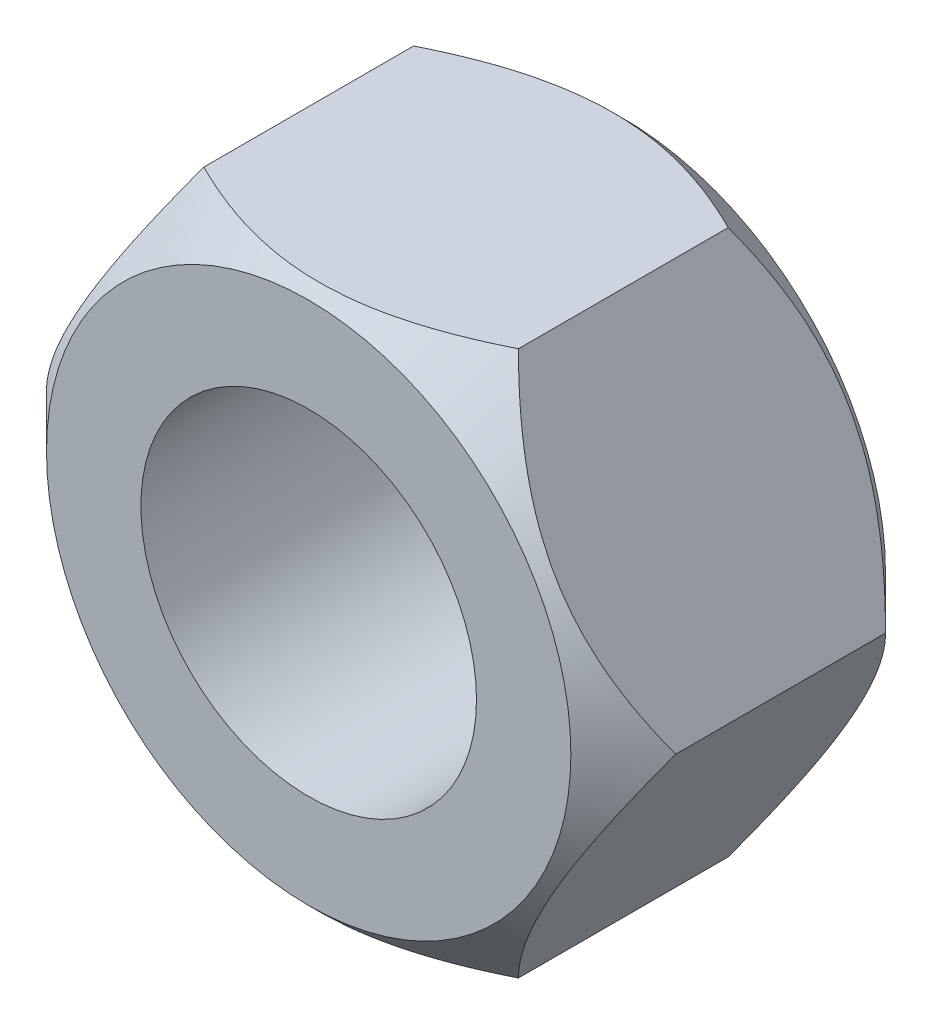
ISO-10303-21;
HEADER;
FILE_DESCRIPTION(('STEP AP214'),'2;1');
FILE_NAME('part.step','',(''),(''),'','','');
FILE_SCHEMA(('AUTOMOTIVE_DESIGN { 1 0 10303 214 1 1 1 1 }'));
ENDSEC;
DATA;
#1=APPLICATION_CONTEXT('core data for automotive mechanical design processes');
#2=APPLICATION_PROTOCOL_DEFINITION('international standard','automotive_design',2000,#1);
#3=PRODUCT_CONTEXT('',#1,'mechanical');
#4=PRODUCT('Part','Part','',(#3));
#5=PRODUCT_RELATED_PRODUCT_CATEGORY('part','',(#4));
#6=PRODUCT_DEFINITION_FORMATION('','',#4);
#7=PRODUCT_DEFINITION_CONTEXT('part definition',#1,'design');
#8=PRODUCT_DEFINITION('design','',#6,#7);
#9=PRODUCT_DEFINITION_SHAPE('','',#8);
#10=(LENGTH_UNIT() NAMED_UNIT(*) SI_UNIT(.MILLI.,.METRE.));
#11=(NAMED_UNIT(*) PLANE_ANGLE_UNIT() SI_UNIT($,.RADIAN.));
#12=(NAMED_UNIT(*) SI_UNIT($,.STERADIAN.) SOLID_ANGLE_UNIT());
#13=UNCERTAINTY_MEASURE_WITH_UNIT(LENGTH_MEASURE(1.E-05),#10,'distance_accuracy_value','');
#14=(GEOMETRIC_REPRESENTATION_CONTEXT(3) GLOBAL_UNCERTAINTY_ASSIGNED_CONTEXT((#13)) GLOBAL_UNIT_ASSIGNED_CONTEXT((#10,
#11,#12)) REPRESENTATION_CONTEXT('',''));
#15=CARTESIAN_POINT('',(0.,0.,0.));
#16=DIRECTION('',(0.,0.,1.));
#17=DIRECTION('',(1.,0.,0.));
#18=AXIS2_PLACEMENT_3D('',#15,#16,#17);
#19=CARTESIAN_POINT('',(0.,0.,0.500000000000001));
#20=DIRECTION('',(0.,0.,1.));
#21=DIRECTION('',(1.,0.,0.));
#22=AXIS2_PLACEMENT_3D('',#19,#20,#21);
#23=CONICAL_SURFACE('',#22,3.,0.78539816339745);
#24=CARTESIAN_POINT('',(0.,0.,0.));
#25=DIRECTION('',(0.,0.,1.));
#26=DIRECTION('',(1.,0.,0.));
#27=AXIS2_PLACEMENT_3D('',#24,#25,#26);
#28=CIRCLE('',#27,2.5);
#29=CARTESIAN_POINT('',(2.5,0.,0.));
#30=VERTEX_POINT('',#29);
#31=EDGE_CURVE('E220',#30,#30,#28,.F.);
#32=ORIENTED_EDGE('',*,*,#31,.F.);
#33=EDGE_LOOP('',(#32));
#34=FACE_BOUND('',#33,.T.);
#35=CARTESIAN_POINT('',(-3.09092547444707,-2.59807621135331,1.53779894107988));
#36=CARTESIAN_POINT('',(-3.01609560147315,-2.59807621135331,1.48052976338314));
#37=CARTESIAN_POINT('',(-2.94085808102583,-2.59807621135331,1.42378477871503));
#38=CARTESIAN_POINT('',(-2.78940274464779,-2.59807621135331,1.3115813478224));
#39=CARTESIAN_POINT('',(-2.71318469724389,-2.59807621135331,1.25612321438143));
#40=CARTESIAN_POINT('',(-2.55904595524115,-2.59807621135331,1.14633691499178));
#41=CARTESIAN_POINT('',(-2.48111665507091,-2.59807621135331,1.0920207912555));
#42=CARTESIAN_POINT('',(-2.3239535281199,-2.59807621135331,0.985316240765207));
#43=CARTESIAN_POINT('',(-2.24471979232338,-2.59807621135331,0.932927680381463));
#44=CARTESIAN_POINT('',(-2.07978975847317,-2.59807621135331,0.827351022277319));
#45=CARTESIAN_POINT('',(-1.99399660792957,-2.59807621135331,0.774313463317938));
#46=CARTESIAN_POINT('',(-1.82042376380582,-2.59807621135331,0.671600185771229));
#47=CARTESIAN_POINT('',(-1.73264433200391,-2.59807621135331,0.621924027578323));
#48=CARTESIAN_POINT('',(-1.55504638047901,-2.59807621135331,0.526971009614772));
#49=CARTESIAN_POINT('',(-1.46523449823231,-2.59807621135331,0.48168183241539));
#50=CARTESIAN_POINT('',(-1.2830963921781,-2.59807621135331,0.396525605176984));
#51=CARTESIAN_POINT('',(-1.19077136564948,-2.59807621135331,0.35665602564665));
#52=CARTESIAN_POINT('',(-1.01220342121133,-2.59807621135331,0.287192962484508));
#53=CARTESIAN_POINT('',(-0.926201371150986,-2.59807621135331,0.256986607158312));
#54=CARTESIAN_POINT('',(-0.752039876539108,-2.59807621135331,0.203461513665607));
#55=CARTESIAN_POINT('',(-0.663880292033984,-2.59807621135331,0.18014322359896));
#56=CARTESIAN_POINT('',(-0.487445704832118,-2.59807621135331,0.142031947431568));
#57=CARTESIAN_POINT('',(-0.399204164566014,-2.59807621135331,0.127086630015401));
#58=CARTESIAN_POINT('',(-0.221667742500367,-2.59807621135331,0.106027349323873));
#59=CARTESIAN_POINT('',(-0.132373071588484,-2.59807621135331,0.0999116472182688));
#60=CARTESIAN_POINT('',(0.0426616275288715,-2.59807621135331,0.0970138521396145));
#61=CARTESIAN_POINT('',(0.128395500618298,-2.59807621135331,0.0998552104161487));
#62=CARTESIAN_POINT('',(0.299175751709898,-2.59807621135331,0.113859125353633));
#63=CARTESIAN_POINT('',(0.384222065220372,-2.59807621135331,0.125022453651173));
#64=CARTESIAN_POINT('',(0.554454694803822,-2.59807621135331,0.155234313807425));
#65=CARTESIAN_POINT('',(0.639616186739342,-2.59807621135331,0.174420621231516));
#66=CARTESIAN_POINT('',(0.808061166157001,-2.59807621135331,0.219628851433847));
#67=CARTESIAN_POINT('',(0.89134477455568,-2.59807621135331,0.245650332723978));
#68=CARTESIAN_POINT('',(1.14922819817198,-2.59807621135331,0.336125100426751));
#69=CARTESIAN_POINT('',(1.32028918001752,-2.59807621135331,0.410699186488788));
#70=CARTESIAN_POINT('',(1.57063806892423,-2.59807621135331,0.535072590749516));
#71=CARTESIAN_POINT('',(1.65320141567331,-2.59807621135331,0.578712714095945));
#72=CARTESIAN_POINT('',(1.81645750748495,-2.59807621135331,0.669369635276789));
#73=CARTESIAN_POINT('',(1.89715058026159,-2.59807621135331,0.716385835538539));
#74=CARTESIAN_POINT('',(2.05293461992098,-2.59807621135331,0.81072400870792));
#75=CARTESIAN_POINT('',(2.12810528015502,-2.59807621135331,0.857915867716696));
#76=CARTESIAN_POINT('',(2.27715698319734,-2.59807621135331,0.954303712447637));
#77=CARTESIAN_POINT('',(2.3510379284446,-2.59807621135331,1.00349984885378));
#78=CARTESIAN_POINT('',(2.49708171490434,-2.59807621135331,1.10313535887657));
#79=CARTESIAN_POINT('',(2.56925360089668,-2.59807621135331,1.15356152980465));
#80=CARTESIAN_POINT('',(2.71260816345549,-2.59807621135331,1.2557612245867));
#81=CARTESIAN_POINT('',(2.7837911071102,-2.59807621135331,1.30753437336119));
#82=CARTESIAN_POINT('',(2.85455959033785,-2.59807621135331,1.35985886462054));
#83=B_SPLINE_CURVE_WITH_KNOTS('',3,(#35,#36,#37,#38,#39,#40,#41,#42,#43,#44,#45,#46,#47,#48,#49,
#50,#51,#52,#53,#54,#55,#56,#57,#58,#59,#60,#61,#62,#63,#64,#65,#66,#67,#68,#69,#70,#71,#72,#73,
#74,#75,#76,#77,#78,#79,#80,#81,#82),.UNSPECIFIED.,.F.,.F.,(4,2,2,2,2,2,2,2,2,2,2,2,2,2,2,2,2,2,
2,2,2,2,2,4),(0.,0.282694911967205,0.565457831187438,0.850405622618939,1.13533362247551,
1.43786342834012,1.74035359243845,2.04196820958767,2.34344156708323,2.61666213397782,
2.88990047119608,3.15799130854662,3.42602934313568,3.68295179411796,3.93989807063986,
4.20145080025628,4.46298664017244,5.02108363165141,5.30122174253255,5.58131039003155,
5.84754726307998,6.11380418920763,6.37791688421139,6.64195680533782),.UNSPECIFIED.);
#84=CARTESIAN_POINT('',(1.5,-2.59807621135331,0.499999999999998));
#85=VERTEX_POINT('',#84);
#86=CARTESIAN_POINT('',(-1.5,-2.59807621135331,0.499999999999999));
#87=VERTEX_POINT('',#86);
#88=EDGE_CURVE('E113',#85,#87,#83,.F.);
#89=ORIENTED_EDGE('',*,*,#88,.T.);
#90=CARTESIAN_POINT('',(-1.49988452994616,-2.59827621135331,0.500115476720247));
#91=CARTESIAN_POINT('',(-1.55144722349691,-2.50896700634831,0.448596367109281));
#92=CARTESIAN_POINT('',(-1.60387211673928,-2.41816442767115,0.400103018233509));
#93=CARTESIAN_POINT('',(-1.71077226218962,-2.23300794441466,0.3113127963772));
#94=CARTESIAN_POINT('',(-1.76525768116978,-2.13863643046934,0.271065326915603));
#95=CARTESIAN_POINT('',(-1.87512493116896,-1.94834077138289,0.20212059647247));
#96=CARTESIAN_POINT('',(-1.93047878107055,-1.85246509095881,0.173250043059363));
#97=CARTESIAN_POINT('',(-2.04240509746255,-1.65860302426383,0.128768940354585));
#98=CARTESIAN_POINT('',(-2.09897414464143,-1.56062256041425,0.113125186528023));
#99=CARTESIAN_POINT('',(-2.19646775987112,-1.39175866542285,0.0990104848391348));
#100=CARTESIAN_POINT('',(-2.237266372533,-1.32109339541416,0.0969210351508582));
#101=CARTESIAN_POINT('',(-2.31879690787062,-1.1798783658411,0.100441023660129));
#102=CARTESIAN_POINT('',(-2.35952880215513,-1.10932865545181,0.106053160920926));
#103=CARTESIAN_POINT('',(-2.44060798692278,-0.968895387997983,0.124656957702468));
#104=CARTESIAN_POINT('',(-2.48095479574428,-0.899012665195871,0.13765687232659));
#105=CARTESIAN_POINT('',(-2.5609507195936,-0.760455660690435,0.170322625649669));
#106=CARTESIAN_POINT('',(-2.60059988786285,-0.691781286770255,0.189987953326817));
#107=CARTESIAN_POINT('',(-2.70215750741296,-0.5158783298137,0.248368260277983));
#108=CARTESIAN_POINT('',(-2.76343628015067,-0.409740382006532,0.291483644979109));
#109=CARTESIAN_POINT('',(-2.853541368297,-0.253673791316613,0.364268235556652));
#110=CARTESIAN_POINT('',(-2.88323502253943,-0.20224287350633,0.389841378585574));
#111=CARTESIAN_POINT('',(-2.94207231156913,-0.100333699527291,0.443318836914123));
#112=CARTESIAN_POINT('',(-2.97121627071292,-0.0498548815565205,0.47122172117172));
#113=CARTESIAN_POINT('',(-3.00011547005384,0.000200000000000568,0.500115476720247));
#114=B_SPLINE_CURVE_WITH_KNOTS('',3,(#90,#91,#92,#93,#94,#95,#96,#97,#98,#99,#100,#101,#102,
#103,#104,#105,#106,#107,#108,#109,#110,#111,#112,#113),.UNSPECIFIED.,.F.,.F.,(4,2,2,2,2,2,2,2,
2,2,2,4),(0.,0.346074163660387,0.694164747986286,1.03672682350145,1.37842635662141,
1.62295169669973,1.86756275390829,2.11244767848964,2.35731383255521,2.74625844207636,
2.94020339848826,3.13403008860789),.UNSPECIFIED.);
#115=CARTESIAN_POINT('',(-3.,0.,0.499999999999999));
#116=VERTEX_POINT('',#115);
#117=EDGE_CURVE('E97',#87,#116,#114,.T.);
#118=ORIENTED_EDGE('',*,*,#117,.T.);
#119=CARTESIAN_POINT('',(-3.00011547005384,-0.000199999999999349,0.500115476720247));
#120=CARTESIAN_POINT('',(-2.94855277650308,0.0891092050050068,0.448596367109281));
#121=CARTESIAN_POINT('',(-2.89612788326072,0.179911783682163,0.400103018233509));
#122=CARTESIAN_POINT('',(-2.78922773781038,0.36506826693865,0.311312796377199));
#123=CARTESIAN_POINT('',(-2.73474231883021,0.459439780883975,0.271065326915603));
#124=CARTESIAN_POINT('',(-2.62487506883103,0.649735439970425,0.20212059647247));
#125=CARTESIAN_POINT('',(-2.56952121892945,0.745611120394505,0.173250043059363));
#126=CARTESIAN_POINT('',(-2.45759490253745,0.939473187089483,0.128768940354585));
#127=CARTESIAN_POINT('',(-2.40102585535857,1.03745365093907,0.113125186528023));
#128=CARTESIAN_POINT('',(-2.30353224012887,1.20631754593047,0.099010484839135));
#129=CARTESIAN_POINT('',(-2.262733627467,1.27698281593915,0.0969210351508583));
#130=CARTESIAN_POINT('',(-2.18120309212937,1.41819784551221,0.100441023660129));
#131=CARTESIAN_POINT('',(-2.14047119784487,1.4887475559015,0.106053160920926));
#132=CARTESIAN_POINT('',(-2.05939201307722,1.62918082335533,0.124656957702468));
#133=CARTESIAN_POINT('',(-2.01904520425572,1.69906354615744,0.13765687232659));
#134=CARTESIAN_POINT('',(-1.9390492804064,1.83762055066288,0.170322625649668));
#135=CARTESIAN_POINT('',(-1.89940011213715,1.90629492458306,0.189987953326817));
#136=CARTESIAN_POINT('',(-1.79784249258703,2.08219788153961,0.248368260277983));
#137=CARTESIAN_POINT('',(-1.73656371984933,2.18833582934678,0.291483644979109));
#138=CARTESIAN_POINT('',(-1.646458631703,2.3444024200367,0.364268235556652));
#139=CARTESIAN_POINT('',(-1.61676497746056,2.39583333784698,0.389841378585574));
#140=CARTESIAN_POINT('',(-1.55792768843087,2.49774251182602,0.443318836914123));
#141=CARTESIAN_POINT('',(-1.52878372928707,2.54822132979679,0.47122172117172));
#142=CARTESIAN_POINT('',(-1.49988452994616,2.59827621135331,0.500115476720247));
#143=B_SPLINE_CURVE_WITH_KNOTS('',3,(#119,#120,#121,#122,#123,#124,#125,#126,#127,#128,#129,
#130,#131,#132,#133,#134,#135,#136,#137,#138,#139,#140,#141,#142),.UNSPECIFIED.,.F.,.F.,(4,2,2,
2,2,2,2,2,2,2,2,4),(0.,0.346074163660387,0.694164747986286,1.03672682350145,1.37842635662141,
1.62295169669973,1.86756275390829,2.11244767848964,2.35731383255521,2.74625844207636,
2.94020339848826,3.13403008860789),.UNSPECIFIED.);
#144=CARTESIAN_POINT('',(-1.5,2.59807621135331,0.499999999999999));
#145=VERTEX_POINT('',#144);
#146=EDGE_CURVE('E163',#116,#145,#143,.T.);
#147=ORIENTED_EDGE('',*,*,#146,.T.);
#148=CARTESIAN_POINT('',(-3.09092547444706,2.59807621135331,1.53779894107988));
#149=CARTESIAN_POINT('',(-3.01609560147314,2.59807621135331,1.48052976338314));
#150=CARTESIAN_POINT('',(-2.94085808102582,2.59807621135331,1.42378477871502));
#151=CARTESIAN_POINT('',(-2.78940274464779,2.59807621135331,1.3115813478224));
#152=CARTESIAN_POINT('',(-2.71318469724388,2.59807621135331,1.25612321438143));
#153=CARTESIAN_POINT('',(-2.55904595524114,2.59807621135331,1.14633691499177));
#154=CARTESIAN_POINT('',(-2.48111665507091,2.59807621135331,1.0920207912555));
#155=CARTESIAN_POINT('',(-2.32395352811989,2.59807621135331,0.985316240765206));
#156=CARTESIAN_POINT('',(-2.24471979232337,2.59807621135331,0.932927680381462));
#157=CARTESIAN_POINT('',(-2.07978975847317,2.59807621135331,0.827351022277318));
#158=CARTESIAN_POINT('',(-1.99399660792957,2.59807621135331,0.774313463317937));
#159=CARTESIAN_POINT('',(-1.82042376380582,2.59807621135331,0.671600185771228));
#160=CARTESIAN_POINT('',(-1.73264433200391,2.59807621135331,0.621924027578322));
#161=CARTESIAN_POINT('',(-1.55504638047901,2.59807621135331,0.526971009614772));
#162=CARTESIAN_POINT('',(-1.46523449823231,2.59807621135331,0.48168183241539));
#163=CARTESIAN_POINT('',(-1.2830963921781,2.59807621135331,0.396525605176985));
#164=CARTESIAN_POINT('',(-1.19077136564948,2.59807621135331,0.356656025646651));
#165=CARTESIAN_POINT('',(-1.01220342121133,2.59807621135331,0.287192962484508));
#166=CARTESIAN_POINT('',(-0.926201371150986,2.59807621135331,0.256986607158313));
#167=CARTESIAN_POINT('',(-0.752039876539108,2.59807621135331,0.203461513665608));
#168=CARTESIAN_POINT('',(-0.663880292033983,2.59807621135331,0.180143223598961));
#169=CARTESIAN_POINT('',(-0.487445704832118,2.59807621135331,0.142031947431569));
#170=CARTESIAN_POINT('',(-0.399204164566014,2.59807621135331,0.127086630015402));
#171=CARTESIAN_POINT('',(-0.221667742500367,2.59807621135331,0.106027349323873));
#172=CARTESIAN_POINT('',(-0.132373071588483,2.59807621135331,0.0999116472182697));
#173=CARTESIAN_POINT('',(0.0426616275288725,2.59807621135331,0.0970138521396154));
#174=CARTESIAN_POINT('',(0.128395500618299,2.59807621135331,0.0998552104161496));
#175=CARTESIAN_POINT('',(0.2991757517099,2.59807621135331,0.113859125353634));
#176=CARTESIAN_POINT('',(0.384222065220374,2.59807621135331,0.125022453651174));
#177=CARTESIAN_POINT('',(0.554454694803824,2.59807621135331,0.155234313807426));
#178=CARTESIAN_POINT('',(0.639616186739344,2.59807621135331,0.174420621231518));
#179=CARTESIAN_POINT('',(0.808061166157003,2.59807621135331,0.219628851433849));
#180=CARTESIAN_POINT('',(0.891344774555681,2.59807621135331,0.245650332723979));
#181=CARTESIAN_POINT('',(1.14922819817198,2.59807621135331,0.336125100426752));
#182=CARTESIAN_POINT('',(1.32028918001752,2.59807621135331,0.41069918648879));
#183=CARTESIAN_POINT('',(1.57063806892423,2.59807621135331,0.535072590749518));
#184=CARTESIAN_POINT('',(1.65320141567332,2.59807621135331,0.578712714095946));
#185=CARTESIAN_POINT('',(1.81645750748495,2.59807621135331,0.669369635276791));
#186=CARTESIAN_POINT('',(1.89715058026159,2.59807621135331,0.716385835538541));
#187=CARTESIAN_POINT('',(2.05293461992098,2.59807621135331,0.810724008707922));
#188=CARTESIAN_POINT('',(2.12810528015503,2.59807621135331,0.857915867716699));
#189=CARTESIAN_POINT('',(2.27715698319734,2.59807621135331,0.954303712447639));
#190=CARTESIAN_POINT('',(2.3510379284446,2.59807621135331,1.00349984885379));
#191=CARTESIAN_POINT('',(2.49708171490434,2.59807621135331,1.10313535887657));
#192=CARTESIAN_POINT('',(2.56925360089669,2.59807621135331,1.15356152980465));
#193=CARTESIAN_POINT('',(2.71260816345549,2.59807621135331,1.25576122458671));
#194=CARTESIAN_POINT('',(2.78379110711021,2.59807621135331,1.3075343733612));
#195=CARTESIAN_POINT('',(2.85455959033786,2.59807621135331,1.35985886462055));
#196=B_SPLINE_CURVE_WITH_KNOTS('',3,(#148,#149,#150,#151,#152,#153,#154,#155,#156,#157,#158,
#159,#160,#161,#162,#163,#164,#165,#166,#167,#168,#169,#170,#171,#172,#173,#174,#175,#176,#177,
#178,#179,#180,#181,#182,#183,#184,#185,#186,#187,#188,#189,#190,#191,#192,#193,#194,#195),
.UNSPECIFIED.,.F.,.F.,(4,2,2,2,2,2,2,2,2,2,2,2,2,2,2,2,2,2,2,2,2,2,2,4),(0.,0.282694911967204,
0.565457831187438,0.850405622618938,1.13533362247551,1.43786342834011,1.74035359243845,
2.04196820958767,2.34344156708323,2.61666213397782,2.88990047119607,3.15799130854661,
3.42602934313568,3.68295179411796,3.93989807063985,4.20145080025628,4.46298664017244,
5.0210836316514,5.30122174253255,5.58131039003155,5.84754726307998,6.11380418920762,
6.37791688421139,6.64195680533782),.UNSPECIFIED.);
#197=CARTESIAN_POINT('',(1.5,2.59807621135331,0.499999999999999));
#198=VERTEX_POINT('',#197);
#199=EDGE_CURVE('E53',#145,#198,#196,.T.);
#200=ORIENTED_EDGE('',*,*,#199,.T.);
#201=CARTESIAN_POINT('',(1.49988452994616,2.59827621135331,0.500115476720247));
#202=CARTESIAN_POINT('',(1.55144722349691,2.50896700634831,0.44859636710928));
#203=CARTESIAN_POINT('',(1.60387211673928,2.41816442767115,0.400103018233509));
#204=CARTESIAN_POINT('',(1.71077226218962,2.23300794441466,0.311312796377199));
#205=CARTESIAN_POINT('',(1.76525768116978,2.13863643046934,0.271065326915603));
#206=CARTESIAN_POINT('',(1.87512493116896,1.94834077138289,0.20212059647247));
#207=CARTESIAN_POINT('',(1.93047878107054,1.85246509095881,0.173250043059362));
#208=CARTESIAN_POINT('',(2.04240509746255,1.65860302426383,0.128768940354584));
#209=CARTESIAN_POINT('',(2.09897414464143,1.56062256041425,0.113125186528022));
#210=CARTESIAN_POINT('',(2.19646775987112,1.39175866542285,0.0990104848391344));
#211=CARTESIAN_POINT('',(2.23726637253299,1.32109339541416,0.0969210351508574));
#212=CARTESIAN_POINT('',(2.31879690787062,1.1798783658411,0.100441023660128));
#213=CARTESIAN_POINT('',(2.35952880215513,1.10932865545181,0.106053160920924));
#214=CARTESIAN_POINT('',(2.44060798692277,0.968895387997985,0.124656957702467));
#215=CARTESIAN_POINT('',(2.48095479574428,0.899012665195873,0.137656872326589));
#216=CARTESIAN_POINT('',(2.5609507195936,0.760455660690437,0.170322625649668));
#217=CARTESIAN_POINT('',(2.60059988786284,0.691781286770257,0.189987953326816));
#218=CARTESIAN_POINT('',(2.70215750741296,0.515878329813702,0.248368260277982));
#219=CARTESIAN_POINT('',(2.76343628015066,0.409740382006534,0.291483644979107));
#220=CARTESIAN_POINT('',(2.853541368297,0.253673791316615,0.36426823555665));
#221=CARTESIAN_POINT('',(2.88323502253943,0.202242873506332,0.389841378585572));
#222=CARTESIAN_POINT('',(2.94207231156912,0.100333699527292,0.443318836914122));
#223=CARTESIAN_POINT('',(2.97121627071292,0.0498548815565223,0.471221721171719));
#224=CARTESIAN_POINT('',(3.00011547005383,-0.000199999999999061,0.500115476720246));
#225=B_SPLINE_CURVE_WITH_KNOTS('',3,(#201,#202,#203,#204,#205,#206,#207,#208,#209,#210,#211,
#212,#213,#214,#215,#216,#217,#218,#219,#220,#221,#222,#223,#224),.UNSPECIFIED.,.F.,.F.,(4,2,2,
2,2,2,2,2,2,2,2,4),(0.,0.346074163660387,0.694164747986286,1.03672682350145,1.37842635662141,
1.62295169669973,1.86756275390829,2.11244767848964,2.35731383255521,2.74625844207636,
2.94020339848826,3.13403008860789),.UNSPECIFIED.);
#226=CARTESIAN_POINT('',(3.,0.,0.499999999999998));
#227=VERTEX_POINT('',#226);
#228=EDGE_CURVE('E61',#198,#227,#225,.T.);
#229=ORIENTED_EDGE('',*,*,#228,.T.);
#230=CARTESIAN_POINT('',(3.00011547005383,0.000200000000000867,0.500115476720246));
#231=CARTESIAN_POINT('',(2.94855277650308,-0.0891092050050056,0.448596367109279));
#232=CARTESIAN_POINT('',(2.89612788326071,-0.179911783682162,0.400103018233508));
#233=CARTESIAN_POINT('',(2.78922773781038,-0.365068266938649,0.311312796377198));
#234=CARTESIAN_POINT('',(2.73474231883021,-0.459439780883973,0.271065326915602));
#235=CARTESIAN_POINT('',(2.62487506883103,-0.649735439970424,0.202120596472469));
#236=CARTESIAN_POINT('',(2.56952121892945,-0.745611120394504,0.173250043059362));
#237=CARTESIAN_POINT('',(2.45759490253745,-0.939473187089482,0.128768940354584));
#238=CARTESIAN_POINT('',(2.40102585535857,-1.03745365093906,0.113125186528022));
#239=CARTESIAN_POINT('',(2.30353224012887,-1.20631754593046,0.0990104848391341));
#240=CARTESIAN_POINT('',(2.262733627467,-1.27698281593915,0.0969210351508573));
#241=CARTESIAN_POINT('',(2.18120309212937,-1.41819784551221,0.100441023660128));
#242=CARTESIAN_POINT('',(2.14047119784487,-1.4887475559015,0.106053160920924));
#243=CARTESIAN_POINT('',(2.05939201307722,-1.62918082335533,0.124656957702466));
#244=CARTESIAN_POINT('',(2.01904520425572,-1.69906354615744,0.137656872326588));
#245=CARTESIAN_POINT('',(1.9390492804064,-1.83762055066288,0.170322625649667));
#246=CARTESIAN_POINT('',(1.89940011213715,-1.90629492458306,0.189987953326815));
#247=CARTESIAN_POINT('',(1.79784249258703,-2.08219788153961,0.248368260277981));
#248=CARTESIAN_POINT('',(1.73656371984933,-2.18833582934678,0.291483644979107));
#249=CARTESIAN_POINT('',(1.646458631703,-2.3444024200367,0.36426823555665));
#250=CARTESIAN_POINT('',(1.61676497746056,-2.39583333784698,0.389841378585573));
#251=CARTESIAN_POINT('',(1.55792768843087,-2.49774251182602,0.443318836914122));
#252=CARTESIAN_POINT('',(1.52878372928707,-2.54822132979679,0.471221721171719));
#253=CARTESIAN_POINT('',(1.49988452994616,-2.59827621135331,0.500115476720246));
#254=B_SPLINE_CURVE_WITH_KNOTS('',3,(#230,#231,#232,#233,#234,#235,#236,#237,#238,#239,#240,
#241,#242,#243,#244,#245,#246,#247,#248,#249,#250,#251,#252,#253),.UNSPECIFIED.,.F.,.F.,(4,2,2,
2,2,2,2,2,2,2,2,4),(0.,0.346074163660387,0.694164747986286,1.03672682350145,1.37842635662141,
1.62295169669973,1.86756275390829,2.11244767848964,2.35731383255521,2.74625844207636,
2.94020339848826,3.13403008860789),.UNSPECIFIED.);
#255=EDGE_CURVE('E146',#227,#85,#254,.T.);
#256=ORIENTED_EDGE('',*,*,#255,.T.);
#257=EDGE_LOOP('',(#89,#118,#147,#200,#229,#256));
#258=FACE_BOUND('',#257,.T.);
#259=ADVANCED_FACE('F33',(#34,#258),#23,.T.);
#260=CARTESIAN_POINT('',(0.,0.,3.));
#261=DIRECTION('',(0.,0.,-1.));
#262=DIRECTION('',(-1.,0.,0.));
#263=AXIS2_PLACEMENT_3D('',#260,#261,#262);
#264=CONICAL_SURFACE('',#263,2.5,0.785398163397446);
#265=CARTESIAN_POINT('',(0.,0.,3.));
#266=DIRECTION('',(0.,0.,1.));
#267=DIRECTION('',(1.,0.,0.));
#268=AXIS2_PLACEMENT_3D('',#265,#266,#267);
#269=CIRCLE('',#268,2.5);
#270=CARTESIAN_POINT('',(2.5,0.,3.));
#271=VERTEX_POINT('',#270);
#272=EDGE_CURVE('E46',#271,#271,#269,.T.);
#273=ORIENTED_EDGE('',*,*,#272,.F.);
#274=EDGE_LOOP('',(#273));
#275=FACE_BOUND('',#274,.T.);
#276=CARTESIAN_POINT('',(-1.49988452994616,2.59827621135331,2.49988452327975));
#277=CARTESIAN_POINT('',(-1.55144722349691,2.50896700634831,2.55140363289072));
#278=CARTESIAN_POINT('',(-1.60387211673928,2.41816442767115,2.59989698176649));
#279=CARTESIAN_POINT('',(-1.71077226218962,2.23300794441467,2.6886872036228));
#280=CARTESIAN_POINT('',(-1.76525768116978,2.13863643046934,2.72893467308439));
#281=CARTESIAN_POINT('',(-1.87512493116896,1.94834077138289,2.79787940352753));
#282=CARTESIAN_POINT('',(-1.93047878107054,1.85246509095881,2.82674995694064));
#283=CARTESIAN_POINT('',(-2.04240509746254,1.65860302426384,2.87123105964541));
#284=CARTESIAN_POINT('',(-2.09897414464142,1.56062256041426,2.88687481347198));
#285=CARTESIAN_POINT('',(-2.19646775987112,1.39175866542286,2.90098951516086));
#286=CARTESIAN_POINT('',(-2.23726637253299,1.32109339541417,2.90307896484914));
#287=CARTESIAN_POINT('',(-2.31879690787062,1.17987836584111,2.89955897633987));
#288=CARTESIAN_POINT('',(-2.35952880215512,1.10932865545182,2.89394683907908));
#289=CARTESIAN_POINT('',(-2.44060798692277,0.968895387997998,2.87534304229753));
#290=CARTESIAN_POINT('',(-2.48095479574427,0.899012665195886,2.86234312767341));
#291=CARTESIAN_POINT('',(-2.56095071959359,0.760455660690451,2.82967737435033));
#292=CARTESIAN_POINT('',(-2.60059988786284,0.691781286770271,2.81001204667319));
#293=CARTESIAN_POINT('',(-2.70215750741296,0.515878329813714,2.75163173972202));
#294=CARTESIAN_POINT('',(-2.76343628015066,0.409740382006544,2.7085163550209));
#295=CARTESIAN_POINT('',(-2.85354136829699,0.253673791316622,2.63573176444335));
#296=CARTESIAN_POINT('',(-2.88323502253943,0.202242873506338,2.61015862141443));
#297=CARTESIAN_POINT('',(-2.94207231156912,0.100333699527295,2.55668116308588));
#298=CARTESIAN_POINT('',(-2.97121627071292,0.0498548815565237,2.52877827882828));
#299=CARTESIAN_POINT('',(-3.00011547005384,-0.00019999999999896,2.49988452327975));
#300=B_SPLINE_CURVE_WITH_KNOTS('',3,(#276,#277,#278,#279,#280,#281,#282,#283,#284,#285,#286,
#287,#288,#289,#290,#291,#292,#293,#294,#295,#296,#297,#298,#299),.UNSPECIFIED.,.F.,.F.,(4,2,2,
2,2,2,2,2,2,2,2,4),(0.,0.346074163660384,0.694164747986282,1.03672682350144,1.3784263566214,
1.62295169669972,1.86756275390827,2.11244767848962,2.35731383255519,2.74625844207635,
2.94020339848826,3.13403008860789),.UNSPECIFIED.);
#301=CARTESIAN_POINT('',(-1.5,2.59807621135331,2.5));
#302=VERTEX_POINT('',#301);
#303=CARTESIAN_POINT('',(-3.,0.,2.5));
#304=VERTEX_POINT('',#303);
#305=EDGE_CURVE('E11',#302,#304,#300,.T.);
#306=ORIENTED_EDGE('',*,*,#305,.T.);
#307=CARTESIAN_POINT('',(-3.00011547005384,0.000200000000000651,2.49988452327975));
#308=CARTESIAN_POINT('',(-2.94855277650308,-0.0891092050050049,2.55140363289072));
#309=CARTESIAN_POINT('',(-2.89612788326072,-0.17991178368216,2.59989698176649));
#310=CARTESIAN_POINT('',(-2.78922773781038,-0.365068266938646,2.6886872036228));
#311=CARTESIAN_POINT('',(-2.73474231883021,-0.45943978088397,2.72893467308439));
#312=CARTESIAN_POINT('',(-2.62487506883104,-0.64973543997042,2.79787940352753));
#313=CARTESIAN_POINT('',(-2.56952121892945,-0.745611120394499,2.82674995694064));
#314=CARTESIAN_POINT('',(-2.45759490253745,-0.939473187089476,2.87123105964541));
#315=CARTESIAN_POINT('',(-2.40102585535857,-1.03745365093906,2.88687481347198));
#316=CARTESIAN_POINT('',(-2.30353224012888,-1.20631754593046,2.90098951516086));
#317=CARTESIAN_POINT('',(-2.26273362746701,-1.27698281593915,2.90307896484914));
#318=CARTESIAN_POINT('',(-2.18120309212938,-1.4181978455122,2.89955897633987));
#319=CARTESIAN_POINT('',(-2.14047119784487,-1.48874755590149,2.89394683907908));
#320=CARTESIAN_POINT('',(-2.05939201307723,-1.62918082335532,2.87534304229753));
#321=CARTESIAN_POINT('',(-2.01904520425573,-1.69906354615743,2.86234312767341));
#322=CARTESIAN_POINT('',(-1.9390492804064,-1.83762055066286,2.82967737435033));
#323=CARTESIAN_POINT('',(-1.89940011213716,-1.90629492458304,2.81001204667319));
#324=CARTESIAN_POINT('',(-1.79784249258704,-2.0821978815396,2.75163173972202));
#325=CARTESIAN_POINT('',(-1.73656371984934,-2.18833582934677,2.70851635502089));
#326=CARTESIAN_POINT('',(-1.646458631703,-2.34440242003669,2.63573176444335));
#327=CARTESIAN_POINT('',(-1.61676497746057,-2.39583333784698,2.61015862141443));
#328=CARTESIAN_POINT('',(-1.55792768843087,-2.49774251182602,2.55668116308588));
#329=CARTESIAN_POINT('',(-1.52878372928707,-2.54822132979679,2.52877827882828));
#330=CARTESIAN_POINT('',(-1.49988452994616,-2.59827621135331,2.49988452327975));
#331=B_SPLINE_CURVE_WITH_KNOTS('',3,(#307,#308,#309,#310,#311,#312,#313,#314,#315,#316,#317,
#318,#319,#320,#321,#322,#323,#324,#325,#326,#327,#328,#329,#330),.UNSPECIFIED.,.F.,.F.,(4,2,2,
2,2,2,2,2,2,2,2,4),(0.,0.346074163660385,0.694164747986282,1.03672682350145,1.37842635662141,
1.62295169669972,1.86756275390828,2.11244767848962,2.35731383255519,2.74625844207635,
2.94020339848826,3.13403008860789),.UNSPECIFIED.);
#332=CARTESIAN_POINT('',(-1.5,-2.59807621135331,2.5));
#333=VERTEX_POINT('',#332);
#334=EDGE_CURVE('E94',#304,#333,#331,.T.);
#335=ORIENTED_EDGE('',*,*,#334,.T.);
#336=CARTESIAN_POINT('',(-3.09092547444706,-2.59807621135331,1.46220105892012));
#337=CARTESIAN_POINT('',(-3.01609560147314,-2.59807621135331,1.51947023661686));
#338=CARTESIAN_POINT('',(-2.94085808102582,-2.59807621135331,1.57621522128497));
#339=CARTESIAN_POINT('',(-2.78940274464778,-2.59807621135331,1.68841865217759));
#340=CARTESIAN_POINT('',(-2.71318469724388,-2.59807621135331,1.74387678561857));
#341=CARTESIAN_POINT('',(-2.55904595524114,-2.59807621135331,1.85366308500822));
#342=CARTESIAN_POINT('',(-2.4811166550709,-2.59807621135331,1.90797920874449));
#343=CARTESIAN_POINT('',(-2.32395352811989,-2.59807621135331,2.01468375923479));
#344=CARTESIAN_POINT('',(-2.24471979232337,-2.59807621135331,2.06707231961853));
#345=CARTESIAN_POINT('',(-2.07978975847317,-2.59807621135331,2.17264897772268));
#346=CARTESIAN_POINT('',(-1.99399660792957,-2.59807621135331,2.22568653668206));
#347=CARTESIAN_POINT('',(-1.82042376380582,-2.59807621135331,2.32839981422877));
#348=CARTESIAN_POINT('',(-1.73264433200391,-2.59807621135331,2.37807597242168));
#349=CARTESIAN_POINT('',(-1.55504638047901,-2.59807621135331,2.47302899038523));
#350=CARTESIAN_POINT('',(-1.46523449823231,-2.59807621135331,2.51831816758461));
#351=CARTESIAN_POINT('',(-1.2830963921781,-2.59807621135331,2.60347439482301));
#352=CARTESIAN_POINT('',(-1.19077136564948,-2.59807621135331,2.64334397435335));
#353=CARTESIAN_POINT('',(-1.01220342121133,-2.59807621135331,2.71280703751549));
#354=CARTESIAN_POINT('',(-0.926201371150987,-2.59807621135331,2.74301339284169));
#355=CARTESIAN_POINT('',(-0.75203987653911,-2.59807621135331,2.79653848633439));
#356=CARTESIAN_POINT('',(-0.663880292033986,-2.59807621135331,2.81985677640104));
#357=CARTESIAN_POINT('',(-0.487445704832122,-2.59807621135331,2.85796805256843));
#358=CARTESIAN_POINT('',(-0.399204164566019,-2.59807621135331,2.8729133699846));
#359=CARTESIAN_POINT('',(-0.221667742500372,-2.59807621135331,2.89397265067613));
#360=CARTESIAN_POINT('',(-0.13237307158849,-2.59807621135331,2.90008835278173));
#361=CARTESIAN_POINT('',(0.0426616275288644,-2.59807621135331,2.90298614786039));
#362=CARTESIAN_POINT('',(0.12839550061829,-2.59807621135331,2.90014478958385));
#363=CARTESIAN_POINT('',(0.299175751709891,-2.59807621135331,2.88614087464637));
#364=CARTESIAN_POINT('',(0.384222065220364,-2.59807621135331,2.87497754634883));
#365=CARTESIAN_POINT('',(0.554454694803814,-2.59807621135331,2.84476568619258));
#366=CARTESIAN_POINT('',(0.639616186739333,-2.59807621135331,2.82557937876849));
#367=CARTESIAN_POINT('',(0.808061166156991,-2.59807621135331,2.78037114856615));
#368=CARTESIAN_POINT('',(0.891344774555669,-2.59807621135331,2.75434966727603));
#369=CARTESIAN_POINT('',(1.14922819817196,-2.59807621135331,2.66387489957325));
#370=CARTESIAN_POINT('',(1.3202891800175,-2.59807621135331,2.58930081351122));
#371=CARTESIAN_POINT('',(1.57063806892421,-2.59807621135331,2.46492740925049));
#372=CARTESIAN_POINT('',(1.65320141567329,-2.59807621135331,2.42128728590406));
#373=CARTESIAN_POINT('',(1.81645750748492,-2.59807621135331,2.33063036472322));
#374=CARTESIAN_POINT('',(1.89715058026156,-2.59807621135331,2.28361416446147));
#375=CARTESIAN_POINT('',(2.05293461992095,-2.59807621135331,2.18927599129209));
#376=CARTESIAN_POINT('',(2.12810528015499,-2.59807621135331,2.14208413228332));
#377=CARTESIAN_POINT('',(2.2771569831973,-2.59807621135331,2.04569628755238));
#378=CARTESIAN_POINT('',(2.35103792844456,-2.59807621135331,1.99650015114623));
#379=CARTESIAN_POINT('',(2.4970817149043,-2.59807621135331,1.89686464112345));
#380=CARTESIAN_POINT('',(2.56925360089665,-2.59807621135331,1.84643847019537));
#381=CARTESIAN_POINT('',(2.71260816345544,-2.59807621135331,1.74423877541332));
#382=CARTESIAN_POINT('',(2.78379110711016,-2.59807621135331,1.69246562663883));
#383=CARTESIAN_POINT('',(2.85455959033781,-2.59807621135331,1.64014113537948));
#384=B_SPLINE_CURVE_WITH_KNOTS('',3,(#336,#337,#338,#339,#340,#341,#342,#343,#344,#345,#346,
#347,#348,#349,#350,#351,#352,#353,#354,#355,#356,#357,#358,#359,#360,#361,#362,#363,#364,#365,
#366,#367,#368,#369,#370,#371,#372,#373,#374,#375,#376,#377,#378,#379,#380,#381,#382,#383),
.UNSPECIFIED.,.F.,.F.,(4,2,2,2,2,2,2,2,2,2,2,2,2,2,2,2,2,2,2,2,2,2,2,4),(0.,0.282694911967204,
0.565457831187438,0.850405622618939,1.13533362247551,1.43786342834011,1.74035359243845,
2.04196820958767,2.34344156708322,2.61666213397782,2.88990047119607,3.1579913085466,
3.42602934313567,3.68295179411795,3.93989807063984,4.20145080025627,4.46298664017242,
5.02108363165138,5.30122174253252,5.58131039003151,5.84754726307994,6.11380418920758,
6.37791688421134,6.64195680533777),.UNSPECIFIED.);
#385=CARTESIAN_POINT('',(1.5,-2.59807621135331,2.5));
#386=VERTEX_POINT('',#385);
#387=EDGE_CURVE('E101',#333,#386,#384,.T.);
#388=ORIENTED_EDGE('',*,*,#387,.T.);
#389=CARTESIAN_POINT('',(1.49988452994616,-2.59827621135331,2.49988452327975));
#390=CARTESIAN_POINT('',(1.55144722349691,-2.50896700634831,2.55140363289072));
#391=CARTESIAN_POINT('',(1.60387211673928,-2.41816442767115,2.59989698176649));
#392=CARTESIAN_POINT('',(1.71077226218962,-2.23300794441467,2.6886872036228));
#393=CARTESIAN_POINT('',(1.76525768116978,-2.13863643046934,2.7289346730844));
#394=CARTESIAN_POINT('',(1.87512493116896,-1.94834077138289,2.79787940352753));
#395=CARTESIAN_POINT('',(1.93047878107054,-1.85246509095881,2.82674995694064));
#396=CARTESIAN_POINT('',(2.04240509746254,-1.65860302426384,2.87123105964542));
#397=CARTESIAN_POINT('',(2.09897414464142,-1.56062256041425,2.88687481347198));
#398=CARTESIAN_POINT('',(2.19646775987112,-1.39175866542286,2.90098951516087));
#399=CARTESIAN_POINT('',(2.23726637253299,-1.32109339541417,2.90307896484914));
#400=CARTESIAN_POINT('',(2.31879690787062,-1.17987836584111,2.89955897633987));
#401=CARTESIAN_POINT('',(2.35952880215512,-1.10932865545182,2.89394683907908));
#402=CARTESIAN_POINT('',(2.44060798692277,-0.968895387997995,2.87534304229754));
#403=CARTESIAN_POINT('',(2.48095479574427,-0.899012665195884,2.86234312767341));
#404=CARTESIAN_POINT('',(2.56095071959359,-0.760455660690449,2.82967737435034));
#405=CARTESIAN_POINT('',(2.60059988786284,-0.691781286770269,2.81001204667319));
#406=CARTESIAN_POINT('',(2.70215750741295,-0.515878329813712,2.75163173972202));
#407=CARTESIAN_POINT('',(2.76343628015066,-0.409740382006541,2.7085163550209));
#408=CARTESIAN_POINT('',(2.85354136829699,-0.253673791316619,2.63573176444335));
#409=CARTESIAN_POINT('',(2.88323502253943,-0.202242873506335,2.61015862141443));
#410=CARTESIAN_POINT('',(2.94207231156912,-0.100333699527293,2.55668116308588));
#411=CARTESIAN_POINT('',(2.97121627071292,-0.0498548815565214,2.52877827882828));
#412=CARTESIAN_POINT('',(3.00011547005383,0.000200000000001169,2.49988452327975));
#413=B_SPLINE_CURVE_WITH_KNOTS('',3,(#389,#390,#391,#392,#393,#394,#395,#396,#397,#398,#399,
#400,#401,#402,#403,#404,#405,#406,#407,#408,#409,#410,#411,#412),.UNSPECIFIED.,.F.,.F.,(4,2,2,
2,2,2,2,2,2,2,2,4),(0.,0.346074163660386,0.694164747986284,1.03672682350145,1.37842635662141,
1.62295169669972,1.86756275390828,2.11244767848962,2.35731383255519,2.74625844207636,
2.94020339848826,3.13403008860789),.UNSPECIFIED.);
#414=CARTESIAN_POINT('',(3.,0.,2.5));
#415=VERTEX_POINT('',#414);
#416=EDGE_CURVE('E141',#386,#415,#413,.T.);
#417=ORIENTED_EDGE('',*,*,#416,.T.);
#418=CARTESIAN_POINT('',(3.00011547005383,-0.000199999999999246,2.49988452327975));
#419=CARTESIAN_POINT('',(2.94855277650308,0.0891092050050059,2.55140363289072));
#420=CARTESIAN_POINT('',(2.89612788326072,0.179911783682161,2.59989698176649));
#421=CARTESIAN_POINT('',(2.78922773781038,0.365068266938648,2.6886872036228));
#422=CARTESIAN_POINT('',(2.73474231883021,0.459439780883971,2.7289346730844));
#423=CARTESIAN_POINT('',(2.62487506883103,0.649735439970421,2.79787940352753));
#424=CARTESIAN_POINT('',(2.56952121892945,0.7456111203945,2.82674995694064));
#425=CARTESIAN_POINT('',(2.45759490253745,0.939473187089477,2.87123105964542));
#426=CARTESIAN_POINT('',(2.40102585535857,1.03745365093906,2.88687481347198));
#427=CARTESIAN_POINT('',(2.30353224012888,1.20631754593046,2.90098951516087));
#428=CARTESIAN_POINT('',(2.262733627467,1.27698281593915,2.90307896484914));
#429=CARTESIAN_POINT('',(2.18120309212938,1.4181978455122,2.89955897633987));
#430=CARTESIAN_POINT('',(2.14047119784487,1.48874755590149,2.89394683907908));
#431=CARTESIAN_POINT('',(2.05939201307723,1.62918082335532,2.87534304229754));
#432=CARTESIAN_POINT('',(2.01904520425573,1.69906354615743,2.86234312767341));
#433=CARTESIAN_POINT('',(1.9390492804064,1.83762055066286,2.82967737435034));
#434=CARTESIAN_POINT('',(1.89940011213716,1.90629492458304,2.81001204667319));
#435=CARTESIAN_POINT('',(1.79784249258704,2.0821978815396,2.75163173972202));
#436=CARTESIAN_POINT('',(1.73656371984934,2.18833582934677,2.7085163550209));
#437=CARTESIAN_POINT('',(1.646458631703,2.34440242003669,2.63573176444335));
#438=CARTESIAN_POINT('',(1.61676497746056,2.39583333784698,2.61015862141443));
#439=CARTESIAN_POINT('',(1.55792768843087,2.49774251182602,2.55668116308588));
#440=CARTESIAN_POINT('',(1.52878372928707,2.54822132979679,2.52877827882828));
#441=CARTESIAN_POINT('',(1.49988452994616,2.59827621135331,2.49988452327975));
#442=B_SPLINE_CURVE_WITH_KNOTS('',3,(#418,#419,#420,#421,#422,#423,#424,#425,#426,#427,#428,
#429,#430,#431,#432,#433,#434,#435,#436,#437,#438,#439,#440,#441),.UNSPECIFIED.,.F.,.F.,(4,2,2,
2,2,2,2,2,2,2,2,4),(0.,0.346074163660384,0.694164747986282,1.03672682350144,1.3784263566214,
1.62295169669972,1.86756275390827,2.11244767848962,2.35731383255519,2.74625844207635,
2.94020339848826,3.13403008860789),.UNSPECIFIED.);
#443=CARTESIAN_POINT('',(1.5,2.59807621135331,2.5));
#444=VERTEX_POINT('',#443);
#445=EDGE_CURVE('E184',#415,#444,#442,.T.);
#446=ORIENTED_EDGE('',*,*,#445,.T.);
#447=CARTESIAN_POINT('',(-3.09092547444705,2.59807621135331,1.46220105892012));
#448=CARTESIAN_POINT('',(-3.01609560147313,2.59807621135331,1.51947023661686));
#449=CARTESIAN_POINT('',(-2.94085808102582,2.59807621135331,1.57621522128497));
#450=CARTESIAN_POINT('',(-2.78940274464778,2.59807621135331,1.68841865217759));
#451=CARTESIAN_POINT('',(-2.71318469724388,2.59807621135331,1.74387678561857));
#452=CARTESIAN_POINT('',(-2.55904595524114,2.59807621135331,1.85366308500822));
#453=CARTESIAN_POINT('',(-2.4811166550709,2.59807621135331,1.9079792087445));
#454=CARTESIAN_POINT('',(-2.32395352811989,2.59807621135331,2.01468375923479));
#455=CARTESIAN_POINT('',(-2.24471979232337,2.59807621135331,2.06707231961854));
#456=CARTESIAN_POINT('',(-2.07978975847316,2.59807621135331,2.17264897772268));
#457=CARTESIAN_POINT('',(-1.99399660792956,2.59807621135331,2.22568653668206));
#458=CARTESIAN_POINT('',(-1.82042376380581,2.59807621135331,2.32839981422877));
#459=CARTESIAN_POINT('',(-1.73264433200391,2.59807621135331,2.37807597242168));
#460=CARTESIAN_POINT('',(-1.55504638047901,2.59807621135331,2.47302899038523));
#461=CARTESIAN_POINT('',(-1.46523449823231,2.59807621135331,2.51831816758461));
#462=CARTESIAN_POINT('',(-1.2830963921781,2.59807621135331,2.60347439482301));
#463=CARTESIAN_POINT('',(-1.19077136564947,2.59807621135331,2.64334397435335));
#464=CARTESIAN_POINT('',(-1.01220342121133,2.59807621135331,2.71280703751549));
#465=CARTESIAN_POINT('',(-0.926201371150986,2.59807621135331,2.74301339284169));
#466=CARTESIAN_POINT('',(-0.752039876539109,2.59807621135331,2.79653848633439));
#467=CARTESIAN_POINT('',(-0.663880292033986,2.59807621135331,2.81985677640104));
#468=CARTESIAN_POINT('',(-0.487445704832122,2.59807621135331,2.85796805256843));
#469=CARTESIAN_POINT('',(-0.399204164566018,2.59807621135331,2.8729133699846));
#470=CARTESIAN_POINT('',(-0.221667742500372,2.59807621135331,2.89397265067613));
#471=CARTESIAN_POINT('',(-0.132373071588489,2.59807621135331,2.90008835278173));
#472=CARTESIAN_POINT('',(0.0426616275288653,2.59807621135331,2.90298614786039));
#473=CARTESIAN_POINT('',(0.128395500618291,2.59807621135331,2.90014478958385));
#474=CARTESIAN_POINT('',(0.299175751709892,2.59807621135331,2.88614087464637));
#475=CARTESIAN_POINT('',(0.384222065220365,2.59807621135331,2.87497754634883));
#476=CARTESIAN_POINT('',(0.554454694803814,2.59807621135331,2.84476568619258));
#477=CARTESIAN_POINT('',(0.639616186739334,2.59807621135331,2.82557937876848));
#478=CARTESIAN_POINT('',(0.808061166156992,2.59807621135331,2.78037114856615));
#479=CARTESIAN_POINT('',(0.89134477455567,2.59807621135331,2.75434966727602));
#480=CARTESIAN_POINT('',(1.14922819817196,2.59807621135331,2.66387489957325));
#481=CARTESIAN_POINT('',(1.3202891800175,2.59807621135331,2.58930081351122));
#482=CARTESIAN_POINT('',(1.57063806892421,2.59807621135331,2.46492740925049));
#483=CARTESIAN_POINT('',(1.65320141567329,2.59807621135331,2.42128728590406));
#484=CARTESIAN_POINT('',(1.81645750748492,2.59807621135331,2.33063036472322));
#485=CARTESIAN_POINT('',(1.89715058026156,2.59807621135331,2.28361416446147));
#486=CARTESIAN_POINT('',(2.05293461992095,2.59807621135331,2.18927599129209));
#487=CARTESIAN_POINT('',(2.12810528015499,2.59807621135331,2.14208413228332));
#488=CARTESIAN_POINT('',(2.2771569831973,2.59807621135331,2.04569628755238));
#489=CARTESIAN_POINT('',(2.35103792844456,2.59807621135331,1.99650015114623));
#490=CARTESIAN_POINT('',(2.4970817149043,2.59807621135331,1.89686464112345));
#491=CARTESIAN_POINT('',(2.56925360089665,2.59807621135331,1.84643847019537));
#492=CARTESIAN_POINT('',(2.71260816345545,2.59807621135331,1.74423877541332));
#493=CARTESIAN_POINT('',(2.78379110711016,2.59807621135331,1.69246562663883));
#494=CARTESIAN_POINT('',(2.85455959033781,2.59807621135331,1.64014113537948));
#495=B_SPLINE_CURVE_WITH_KNOTS('',3,(#447,#448,#449,#450,#451,#452,#453,#454,#455,#456,#457,
#458,#459,#460,#461,#462,#463,#464,#465,#466,#467,#468,#469,#470,#471,#472,#473,#474,#475,#476,
#477,#478,#479,#480,#481,#482,#483,#484,#485,#486,#487,#488,#489,#490,#491,#492,#493,#494),
.UNSPECIFIED.,.F.,.F.,(4,2,2,2,2,2,2,2,2,2,2,2,2,2,2,2,2,2,2,2,2,2,2,4),(0.,0.282694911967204,
0.565457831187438,0.850405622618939,1.13533362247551,1.43786342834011,1.74035359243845,
2.04196820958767,2.34344156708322,2.61666213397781,2.88990047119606,3.1579913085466,
3.42602934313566,3.68295179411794,3.93989807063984,4.20145080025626,4.46298664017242,
5.02108363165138,5.30122174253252,5.58131039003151,5.84754726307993,6.11380418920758,
6.37791688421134,6.64195680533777),.UNSPECIFIED.);
#496=EDGE_CURVE('E188',#444,#302,#495,.F.);
#497=ORIENTED_EDGE('',*,*,#496,.T.);
#498=EDGE_LOOP('',(#306,#335,#388,#417,#446,#497));
#499=FACE_BOUND('',#498,.T.);
#500=ADVANCED_FACE('F35',(#275,#499),#264,.T.);
#501=CARTESIAN_POINT('',(0.,0.,3.));
#502=DIRECTION('',(0.,0.,1.));
#503=DIRECTION('',(1.,0.,0.));
#504=AXIS2_PLACEMENT_3D('',#501,#502,#503);
#505=PLANE('',#504);
#506=CARTESIAN_POINT('',(0.,0.,3.));
#507=DIRECTION('',(0.,0.,1.));
#508=DIRECTION('',(1.,0.,0.));
#509=AXIS2_PLACEMENT_3D('',#506,#507,#508);
#510=CIRCLE('',#509,1.6);
#511=CARTESIAN_POINT('',(1.6,0.,3.));
#512=VERTEX_POINT('',#511);
#513=EDGE_CURVE('E217',#512,#512,#510,.T.);
#514=ORIENTED_EDGE('',*,*,#513,.F.);
#515=EDGE_LOOP('',(#514));
#516=FACE_BOUND('',#515,.T.);
#517=ORIENTED_EDGE('',*,*,#272,.T.);
#518=EDGE_LOOP('',(#517));
#519=FACE_BOUND('',#518,.T.);
#520=ADVANCED_FACE('F205',(#516,#519),#505,.T.);
#521=CARTESIAN_POINT('',(0.,0.,0.));
#522=DIRECTION('',(0.,0.,1.));
#523=DIRECTION('',(1.,0.,0.));
#524=AXIS2_PLACEMENT_3D('',#521,#522,#523);
#525=PLANE('',#524);
#526=CARTESIAN_POINT('',(0.,0.,0.));
#527=DIRECTION('',(0.,0.,1.));
#528=DIRECTION('',(1.,0.,0.));
#529=AXIS2_PLACEMENT_3D('',#526,#527,#528);
#530=CIRCLE('',#529,1.6);
#531=CARTESIAN_POINT('',(1.6,0.,0.));
#532=VERTEX_POINT('',#531);
#533=EDGE_CURVE('E222',#532,#532,#530,.T.);
#534=ORIENTED_EDGE('',*,*,#533,.T.);
#535=EDGE_LOOP('',(#534));
#536=FACE_BOUND('',#535,.T.);
#537=ORIENTED_EDGE('',*,*,#31,.T.);
#538=EDGE_LOOP('',(#537));
#539=FACE_BOUND('',#538,.T.);
#540=ADVANCED_FACE('F158',(#536,#539),#525,.F.);
#541=CARTESIAN_POINT('',(0.,0.,0.));
#542=DIRECTION('',(0.,0.,1.));
#543=DIRECTION('',(1.,0.,0.));
#544=AXIS2_PLACEMENT_3D('',#541,#542,#543);
#545=CYLINDRICAL_SURFACE('',#544,1.6);
#546=ORIENTED_EDGE('',*,*,#533,.F.);
#547=EDGE_LOOP('',(#546));
#548=FACE_BOUND('',#547,.T.);
#549=ORIENTED_EDGE('',*,*,#513,.T.);
#550=EDGE_LOOP('',(#549));
#551=FACE_BOUND('',#550,.T.);
#552=ADVANCED_FACE('F200',(#548,#551),#545,.F.);
#553=CARTESIAN_POINT('',(-2.25,1.29903810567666,0.));
#554=DIRECTION('',(-0.866025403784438,0.5,0.));
#555=DIRECTION('',(-0.5,-0.866025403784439,0.));
#556=AXIS2_PLACEMENT_3D('',#553,#554,#555);
#557=PLANE('',#556);
#558=DIRECTION('',(0.,0.,1.));
#559=VECTOR('',#558,1.);
#560=CARTESIAN_POINT('',(-3.,0.,0.));
#561=LINE('',#560,#559);
#562=EDGE_CURVE('E236',#116,#304,#561,.T.);
#563=ORIENTED_EDGE('',*,*,#562,.T.);
#564=ORIENTED_EDGE('',*,*,#305,.F.);
#565=DIRECTION('',(0.,0.,1.));
#566=VECTOR('',#565,1.);
#567=CARTESIAN_POINT('',(-1.5,2.59807621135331,0.));
#568=LINE('',#567,#566);
#569=EDGE_CURVE('E237',#145,#302,#568,.T.);
#570=ORIENTED_EDGE('',*,*,#569,.F.);
#571=ORIENTED_EDGE('',*,*,#146,.F.);
#572=EDGE_LOOP('',(#563,#564,#570,#571));
#573=FACE_BOUND('',#572,.T.);
#574=ADVANCED_FACE('F195',(#573),#557,.T.);
#575=CARTESIAN_POINT('',(0.,2.59807621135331,0.));
#576=DIRECTION('',(0.,1.,0.));
#577=DIRECTION('',(-1.,0.,0.));
#578=AXIS2_PLACEMENT_3D('',#575,#576,#577);
#579=PLANE('',#578);
#580=ORIENTED_EDGE('',*,*,#569,.T.);
#581=ORIENTED_EDGE('',*,*,#496,.F.);
#582=DIRECTION('',(0.,0.,1.));
#583=VECTOR('',#582,1.);
#584=CARTESIAN_POINT('',(1.5,2.59807621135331,0.));
#585=LINE('',#584,#583);
#586=EDGE_CURVE('E183',#198,#444,#585,.T.);
#587=ORIENTED_EDGE('',*,*,#586,.F.);
#588=ORIENTED_EDGE('',*,*,#199,.F.);
#589=EDGE_LOOP('',(#580,#581,#587,#588));
#590=FACE_BOUND('',#589,.T.);
#591=ADVANCED_FACE('F192',(#590),#579,.T.);
#592=CARTESIAN_POINT('',(2.25,1.29903810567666,0.));
#593=DIRECTION('',(0.866025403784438,0.5,0.));
#594=DIRECTION('',(-0.5,0.866025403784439,0.));
#595=AXIS2_PLACEMENT_3D('',#592,#593,#594);
#596=PLANE('',#595);
#597=ORIENTED_EDGE('',*,*,#586,.T.);
#598=ORIENTED_EDGE('',*,*,#445,.F.);
#599=DIRECTION('',(0.,0.,1.));
#600=VECTOR('',#599,1.);
#601=CARTESIAN_POINT('',(3.,0.,0.));
#602=LINE('',#601,#600);
#603=EDGE_CURVE('E152',#227,#415,#602,.T.);
#604=ORIENTED_EDGE('',*,*,#603,.F.);
#605=ORIENTED_EDGE('',*,*,#228,.F.);
#606=EDGE_LOOP('',(#597,#598,#604,#605));
#607=FACE_BOUND('',#606,.T.);
#608=ADVANCED_FACE('F135',(#607),#596,.T.);
#609=CARTESIAN_POINT('',(2.25,-1.29903810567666,0.));
#610=DIRECTION('',(0.866025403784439,-0.5,0.));
#611=DIRECTION('',(0.5,0.866025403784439,0.));
#612=AXIS2_PLACEMENT_3D('',#609,#610,#611);
#613=PLANE('',#612);
#614=ORIENTED_EDGE('',*,*,#603,.T.);
#615=ORIENTED_EDGE('',*,*,#416,.F.);
#616=DIRECTION('',(0.,0.,1.));
#617=VECTOR('',#616,1.);
#618=CARTESIAN_POINT('',(1.5,-2.59807621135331,0.));
#619=LINE('',#618,#617);
#620=EDGE_CURVE('E112',#85,#386,#619,.T.);
#621=ORIENTED_EDGE('',*,*,#620,.F.);
#622=ORIENTED_EDGE('',*,*,#255,.F.);
#623=EDGE_LOOP('',(#614,#615,#621,#622));
#624=FACE_BOUND('',#623,.T.);
#625=ADVANCED_FACE('F129',(#624),#613,.T.);
#626=CARTESIAN_POINT('',(0.,-2.59807621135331,0.));
#627=DIRECTION('',(0.,-1.,0.));
#628=DIRECTION('',(1.,0.,0.));
#629=AXIS2_PLACEMENT_3D('',#626,#627,#628);
#630=PLANE('',#629);
#631=ORIENTED_EDGE('',*,*,#620,.T.);
#632=ORIENTED_EDGE('',*,*,#387,.F.);
#633=DIRECTION('',(0.,0.,1.));
#634=VECTOR('',#633,1.);
#635=CARTESIAN_POINT('',(-1.5,-2.59807621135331,0.));
#636=LINE('',#635,#634);
#637=EDGE_CURVE('E91',#87,#333,#636,.T.);
#638=ORIENTED_EDGE('',*,*,#637,.F.);
#639=ORIENTED_EDGE('',*,*,#88,.F.);
#640=EDGE_LOOP('',(#631,#632,#638,#639));
#641=FACE_BOUND('',#640,.T.);
#642=ADVANCED_FACE('F110',(#641),#630,.T.);
#643=CARTESIAN_POINT('',(-2.25,-1.29903810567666,0.));
#644=DIRECTION('',(-0.866025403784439,-0.5,0.));
#645=DIRECTION('',(0.5,-0.866025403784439,0.));
#646=AXIS2_PLACEMENT_3D('',#643,#644,#645);
#647=PLANE('',#646);
#648=ORIENTED_EDGE('',*,*,#637,.T.);
#649=ORIENTED_EDGE('',*,*,#334,.F.);
#650=ORIENTED_EDGE('',*,*,#562,.F.);
#651=ORIENTED_EDGE('',*,*,#117,.F.);
#652=EDGE_LOOP('',(#648,#649,#650,#651));
#653=FACE_BOUND('',#652,.T.);
#654=ADVANCED_FACE('F93',(#653),#647,.T.);
#655=CLOSED_SHELL('',(#259,#500,#520,#540,#552,#574,#591,#608,#625,#642,#654));
#656=MANIFOLD_SOLID_BREP('B2',#655);
#657=ADVANCED_BREP_SHAPE_REPRESENTATION('',(#18,#656),#14);
#658=SHAPE_DEFINITION_REPRESENTATION(#9,#657);
ENDSEC;
END-ISO-10303-21;
